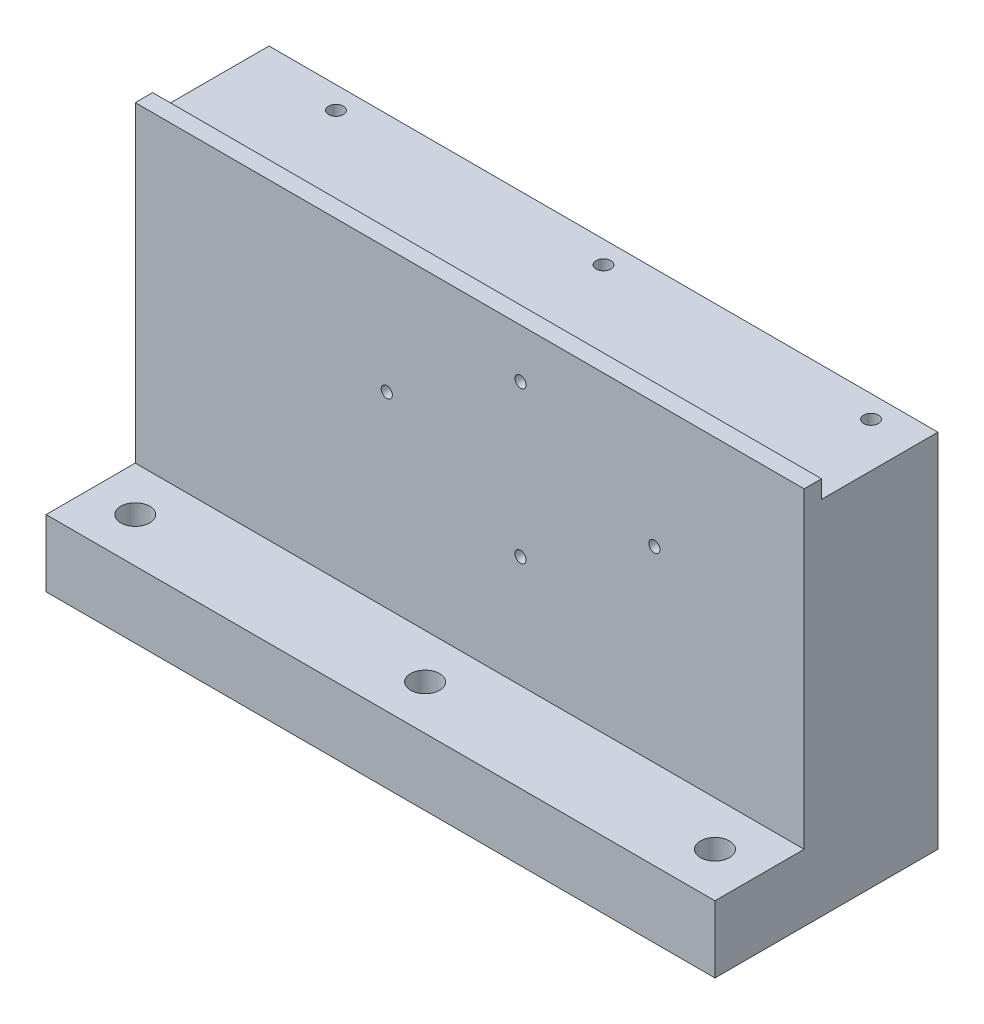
ISO-10303-21;
HEADER;
FILE_DESCRIPTION(('STEP AP214'),'2;1');
FILE_NAME('part.step','',(''),(''),'','','');
FILE_SCHEMA(('AUTOMOTIVE_DESIGN { 1 0 10303 214 1 1 1 1 }'));
ENDSEC;
DATA;
#1=APPLICATION_CONTEXT('core data for automotive mechanical design processes');
#2=APPLICATION_PROTOCOL_DEFINITION('international standard','automotive_design',2000,#1);
#3=PRODUCT_CONTEXT('',#1,'mechanical');
#4=PRODUCT('Part','Part','',(#3));
#5=PRODUCT_RELATED_PRODUCT_CATEGORY('part','',(#4));
#6=PRODUCT_DEFINITION_FORMATION('','',#4);
#7=PRODUCT_DEFINITION_CONTEXT('part definition',#1,'design');
#8=PRODUCT_DEFINITION('design','',#6,#7);
#9=PRODUCT_DEFINITION_SHAPE('','',#8);
#10=(LENGTH_UNIT() NAMED_UNIT(*) SI_UNIT(.MILLI.,.METRE.));
#11=(NAMED_UNIT(*) PLANE_ANGLE_UNIT() SI_UNIT($,.RADIAN.));
#12=(NAMED_UNIT(*) SI_UNIT($,.STERADIAN.) SOLID_ANGLE_UNIT());
#13=UNCERTAINTY_MEASURE_WITH_UNIT(LENGTH_MEASURE(1.E-05),#10,'distance_accuracy_value','');
#14=(GEOMETRIC_REPRESENTATION_CONTEXT(3) GLOBAL_UNCERTAINTY_ASSIGNED_CONTEXT((#13)) GLOBAL_UNIT_ASSIGNED_CONTEXT((#10,
#11,#12)) REPRESENTATION_CONTEXT('',''));
#15=CARTESIAN_POINT('',(0.,0.,0.));
#16=DIRECTION('',(0.,0.,1.));
#17=DIRECTION('',(1.,0.,0.));
#18=AXIS2_PLACEMENT_3D('',#15,#16,#17);
#19=CARTESIAN_POINT('',(150.,0.,50.));
#20=DIRECTION('',(-1.,0.,0.));
#21=DIRECTION('',(0.,0.,1.));
#22=AXIS2_PLACEMENT_3D('',#19,#20,#21);
#23=PLANE('',#22);
#24=DIRECTION('',(0.,0.,1.));
#25=VECTOR('',#24,1.);
#26=CARTESIAN_POINT('',(150.,15.,50.));
#27=LINE('',#26,#25);
#28=CARTESIAN_POINT('',(150.,15.,30.0000000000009));
#29=VERTEX_POINT('',#28);
#30=CARTESIAN_POINT('',(150.,15.,50.));
#31=VERTEX_POINT('',#30);
#32=EDGE_CURVE('E113',#29,#31,#27,.T.);
#33=ORIENTED_EDGE('',*,*,#32,.T.);
#34=DIRECTION('',(0.,1.,0.));
#35=VECTOR('',#34,1.);
#36=CARTESIAN_POINT('',(150.,0.,50.));
#37=LINE('',#36,#35);
#38=CARTESIAN_POINT('',(150.,0.,50.));
#39=VERTEX_POINT('',#38);
#40=EDGE_CURVE('E148',#39,#31,#37,.T.);
#41=ORIENTED_EDGE('',*,*,#40,.F.);
#42=DIRECTION('',(0.,0.,-1.));
#43=VECTOR('',#42,1.);
#44=CARTESIAN_POINT('',(150.,0.,50.));
#45=LINE('',#44,#43);
#46=CARTESIAN_POINT('',(150.,0.,0.));
#47=VERTEX_POINT('',#46);
#48=EDGE_CURVE('E12',#39,#47,#45,.T.);
#49=ORIENTED_EDGE('',*,*,#48,.T.);
#50=DIRECTION('',(0.,1.,0.));
#51=VECTOR('',#50,1.);
#52=CARTESIAN_POINT('',(150.,0.,0.));
#53=LINE('',#52,#51);
#54=CARTESIAN_POINT('',(150.,81.0000000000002,0.));
#55=VERTEX_POINT('',#54);
#56=EDGE_CURVE('E157',#47,#55,#53,.T.);
#57=ORIENTED_EDGE('',*,*,#56,.T.);
#58=DIRECTION('',(0.,0.,1.));
#59=VECTOR('',#58,1.);
#60=CARTESIAN_POINT('',(150.,81.0000000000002,26.1000000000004));
#61=LINE('',#60,#59);
#62=CARTESIAN_POINT('',(150.,81.0000000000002,26.1000000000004));
#63=VERTEX_POINT('',#62);
#64=EDGE_CURVE('E56',#55,#63,#61,.T.);
#65=ORIENTED_EDGE('',*,*,#64,.T.);
#66=DIRECTION('',(0.,1.,0.));
#67=VECTOR('',#66,1.);
#68=CARTESIAN_POINT('',(150.,81.0000000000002,26.1000000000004));
#69=LINE('',#68,#67);
#70=CARTESIAN_POINT('',(150.,85.0000000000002,26.1000000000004));
#71=VERTEX_POINT('',#70);
#72=EDGE_CURVE('E104',#63,#71,#69,.T.);
#73=ORIENTED_EDGE('',*,*,#72,.T.);
#74=DIRECTION('',(0.,0.,-1.));
#75=VECTOR('',#74,1.);
#76=CARTESIAN_POINT('',(150.,84.9999999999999,50.));
#77=LINE('',#76,#75);
#78=CARTESIAN_POINT('',(150.,85.0000000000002,30.));
#79=VERTEX_POINT('',#78);
#80=EDGE_CURVE('E41',#79,#71,#77,.T.);
#81=ORIENTED_EDGE('',*,*,#80,.F.);
#82=DIRECTION('',(0.,-1.,0.));
#83=VECTOR('',#82,1.);
#84=CARTESIAN_POINT('',(150.,15.,30.0000000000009));
#85=LINE('',#84,#83);
#86=EDGE_CURVE('E130',#79,#29,#85,.T.);
#87=ORIENTED_EDGE('',*,*,#86,.T.);
#88=EDGE_LOOP('',(#33,#41,#49,#57,#65,#73,#81,#87));
#89=FACE_BOUND('',#88,.T.);
#90=ADVANCED_FACE('F33',(#89),#23,.F.);
#91=CARTESIAN_POINT('',(0.,84.9999999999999,50.));
#92=DIRECTION('',(0.,-1.,0.));
#93=DIRECTION('',(0.,0.,-1.));
#94=AXIS2_PLACEMENT_3D('',#91,#92,#93);
#95=PLANE('',#94);
#96=DIRECTION('',(1.,0.,0.));
#97=VECTOR('',#96,1.);
#98=CARTESIAN_POINT('',(0.,85.0000000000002,30.));
#99=LINE('',#98,#97);
#100=CARTESIAN_POINT('',(0.,85.0000000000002,30.));
#101=VERTEX_POINT('',#100);
#102=EDGE_CURVE('E141',#101,#79,#99,.T.);
#103=ORIENTED_EDGE('',*,*,#102,.T.);
#104=ORIENTED_EDGE('',*,*,#80,.T.);
#105=DIRECTION('',(1.,0.,0.));
#106=VECTOR('',#105,1.);
#107=CARTESIAN_POINT('',(0.,85.0000000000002,26.1000000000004));
#108=LINE('',#107,#106);
#109=CARTESIAN_POINT('',(0.,85.0000000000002,26.1000000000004));
#110=VERTEX_POINT('',#109);
#111=EDGE_CURVE('E105',#110,#71,#108,.T.);
#112=ORIENTED_EDGE('',*,*,#111,.F.);
#113=DIRECTION('',(0.,0.,-1.));
#114=VECTOR('',#113,1.);
#115=CARTESIAN_POINT('',(0.,84.9999999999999,50.));
#116=LINE('',#115,#114);
#117=EDGE_CURVE('E119',#101,#110,#116,.T.);
#118=ORIENTED_EDGE('',*,*,#117,.F.);
#119=EDGE_LOOP('',(#103,#104,#112,#118));
#120=FACE_BOUND('',#119,.T.);
#121=ADVANCED_FACE('F166',(#120),#95,.F.);
#122=CARTESIAN_POINT('',(0.,0.,50.));
#123=DIRECTION('',(1.,0.,0.));
#124=DIRECTION('',(0.,0.,-1.));
#125=AXIS2_PLACEMENT_3D('',#122,#123,#124);
#126=PLANE('',#125);
#127=CARTESIAN_POINT('',(0.,61.9999999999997,24.));
#128=DIRECTION('',(-1.,0.,0.));
#129=DIRECTION('',(0.,0.,1.));
#130=AXIS2_PLACEMENT_3D('',#127,#128,#129);
#131=CIRCLE('',#130,2.1);
#132=CARTESIAN_POINT('',(0.,61.9999999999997,26.1));
#133=VERTEX_POINT('',#132);
#134=EDGE_CURVE('E232',#133,#133,#131,.T.);
#135=ORIENTED_EDGE('',*,*,#134,.F.);
#136=EDGE_LOOP('',(#135));
#137=FACE_BOUND('',#136,.T.);
#138=CARTESIAN_POINT('',(0.,61.9999999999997,6.));
#139=DIRECTION('',(-1.,0.,0.));
#140=DIRECTION('',(0.,0.,1.));
#141=AXIS2_PLACEMENT_3D('',#138,#139,#140);
#142=CIRCLE('',#141,2.1);
#143=CARTESIAN_POINT('',(0.,61.9999999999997,8.1));
#144=VERTEX_POINT('',#143);
#145=EDGE_CURVE('E241',#144,#144,#142,.T.);
#146=ORIENTED_EDGE('',*,*,#145,.F.);
#147=EDGE_LOOP('',(#146));
#148=FACE_BOUND('',#147,.T.);
#149=DIRECTION('',(0.,0.,1.));
#150=VECTOR('',#149,1.);
#151=CARTESIAN_POINT('',(0.,15.,50.));
#152=LINE('',#151,#150);
#153=CARTESIAN_POINT('',(0.,15.,30.0000000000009));
#154=VERTEX_POINT('',#153);
#155=CARTESIAN_POINT('',(0.,15.,50.));
#156=VERTEX_POINT('',#155);
#157=EDGE_CURVE('E48',#154,#156,#152,.T.);
#158=ORIENTED_EDGE('',*,*,#157,.F.);
#159=DIRECTION('',(0.,-1.,0.));
#160=VECTOR('',#159,1.);
#161=CARTESIAN_POINT('',(0.,15.,30.0000000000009));
#162=LINE('',#161,#160);
#163=EDGE_CURVE('E120',#101,#154,#162,.T.);
#164=ORIENTED_EDGE('',*,*,#163,.F.);
#165=ORIENTED_EDGE('',*,*,#117,.T.);
#166=DIRECTION('',(0.,1.,0.));
#167=VECTOR('',#166,1.);
#168=CARTESIAN_POINT('',(0.,81.0000000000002,26.1000000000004));
#169=LINE('',#168,#167);
#170=CARTESIAN_POINT('',(0.,81.0000000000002,26.1000000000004));
#171=VERTEX_POINT('',#170);
#172=EDGE_CURVE('E101',#171,#110,#169,.T.);
#173=ORIENTED_EDGE('',*,*,#172,.F.);
#174=DIRECTION('',(0.,0.,1.));
#175=VECTOR('',#174,1.);
#176=CARTESIAN_POINT('',(0.,81.0000000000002,26.1000000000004));
#177=LINE('',#176,#175);
#178=CARTESIAN_POINT('',(0.,81.0000000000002,0.));
#179=VERTEX_POINT('',#178);
#180=EDGE_CURVE('E108',#179,#171,#177,.T.);
#181=ORIENTED_EDGE('',*,*,#180,.F.);
#182=DIRECTION('',(0.,-1.,0.));
#183=VECTOR('',#182,1.);
#184=CARTESIAN_POINT('',(0.,0.,0.));
#185=LINE('',#184,#183);
#186=CARTESIAN_POINT('',(0.,0.,0.));
#187=VERTEX_POINT('',#186);
#188=EDGE_CURVE('E149',#179,#187,#185,.T.);
#189=ORIENTED_EDGE('',*,*,#188,.T.);
#190=DIRECTION('',(0.,0.,-1.));
#191=VECTOR('',#190,1.);
#192=CARTESIAN_POINT('',(0.,0.,50.));
#193=LINE('',#192,#191);
#194=CARTESIAN_POINT('',(0.,0.,50.));
#195=VERTEX_POINT('',#194);
#196=EDGE_CURVE('E154',#195,#187,#193,.T.);
#197=ORIENTED_EDGE('',*,*,#196,.F.);
#198=DIRECTION('',(0.,-1.,0.));
#199=VECTOR('',#198,1.);
#200=CARTESIAN_POINT('',(0.,0.,50.));
#201=LINE('',#200,#199);
#202=EDGE_CURVE('E152',#156,#195,#201,.T.);
#203=ORIENTED_EDGE('',*,*,#202,.F.);
#204=EDGE_LOOP('',(#158,#164,#165,#173,#181,#189,#197,#203));
#205=FACE_BOUND('',#204,.T.);
#206=ADVANCED_FACE('F116',(#137,#148,#205),#126,.F.);
#207=CARTESIAN_POINT('',(150.,0.,50.));
#208=DIRECTION('',(0.,0.,1.));
#209=DIRECTION('',(1.,0.,0.));
#210=AXIS2_PLACEMENT_3D('',#207,#208,#209);
#211=PLANE('',#210);
#212=ORIENTED_EDGE('',*,*,#40,.T.);
#213=DIRECTION('',(1.,0.,0.));
#214=VECTOR('',#213,1.);
#215=CARTESIAN_POINT('',(0.,15.,50.));
#216=LINE('',#215,#214);
#217=EDGE_CURVE('E137',#156,#31,#216,.T.);
#218=ORIENTED_EDGE('',*,*,#217,.F.);
#219=ORIENTED_EDGE('',*,*,#202,.T.);
#220=DIRECTION('',(1.,0.,0.));
#221=VECTOR('',#220,1.);
#222=CARTESIAN_POINT('',(0.,0.,50.));
#223=LINE('',#222,#221);
#224=EDGE_CURVE('E145',#195,#39,#223,.T.);
#225=ORIENTED_EDGE('',*,*,#224,.T.);
#226=EDGE_LOOP('',(#212,#218,#219,#225));
#227=FACE_BOUND('',#226,.T.);
#228=ADVANCED_FACE('F177',(#227),#211,.T.);
#229=CARTESIAN_POINT('',(150.,0.,0.));
#230=DIRECTION('',(0.,0.,1.));
#231=DIRECTION('',(1.,0.,0.));
#232=AXIS2_PLACEMENT_3D('',#229,#230,#231);
#233=PLANE('',#232);
#234=CARTESIAN_POINT('',(116.25,70.0000000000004,0.));
#235=DIRECTION('',(0.,0.,-1.));
#236=DIRECTION('',(-1.,0.,0.));
#237=AXIS2_PLACEMENT_3D('',#234,#235,#236);
#238=CIRCLE('',#237,1.64999999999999);
#239=CARTESIAN_POINT('',(114.6,70.0000000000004,0.));
#240=VERTEX_POINT('',#239);
#241=EDGE_CURVE('E247',#240,#240,#238,.T.);
#242=ORIENTED_EDGE('',*,*,#241,.F.);
#243=EDGE_LOOP('',(#242));
#244=FACE_BOUND('',#243,.T.);
#245=CARTESIAN_POINT('',(146.25,70.0000000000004,0.));
#246=DIRECTION('',(0.,0.,-1.));
#247=DIRECTION('',(-1.,0.,0.));
#248=AXIS2_PLACEMENT_3D('',#245,#246,#247);
#249=CIRCLE('',#248,1.65000000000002);
#250=CARTESIAN_POINT('',(144.6,70.0000000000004,0.));
#251=VERTEX_POINT('',#250);
#252=EDGE_CURVE('E253',#251,#251,#249,.T.);
#253=ORIENTED_EDGE('',*,*,#252,.F.);
#254=EDGE_LOOP('',(#253));
#255=FACE_BOUND('',#254,.T.);
#256=DIRECTION('',(1.,0.,0.));
#257=VECTOR('',#256,1.);
#258=CARTESIAN_POINT('',(0.,81.0000000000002,0.));
#259=LINE('',#258,#257);
#260=EDGE_CURVE('E110',#179,#55,#259,.T.);
#261=ORIENTED_EDGE('',*,*,#260,.T.);
#262=ORIENTED_EDGE('',*,*,#56,.F.);
#263=DIRECTION('',(1.,0.,0.));
#264=VECTOR('',#263,1.);
#265=CARTESIAN_POINT('',(0.,0.,0.));
#266=LINE('',#265,#264);
#267=EDGE_CURVE('E136',#187,#47,#266,.T.);
#268=ORIENTED_EDGE('',*,*,#267,.F.);
#269=ORIENTED_EDGE('',*,*,#188,.F.);
#270=EDGE_LOOP('',(#261,#262,#268,#269));
#271=FACE_BOUND('',#270,.T.);
#272=ADVANCED_FACE('F171',(#244,#255,#271),#233,.F.);
#273=CARTESIAN_POINT('',(0.,0.,50.));
#274=DIRECTION('',(0.,1.,0.));
#275=DIRECTION('',(0.,0.,1.));
#276=AXIS2_PLACEMENT_3D('',#273,#274,#275);
#277=PLANE('',#276);
#278=CARTESIAN_POINT('',(140.,0.,40.));
#279=DIRECTION('',(0.,1.,0.));
#280=DIRECTION('',(0.,0.,1.));
#281=AXIS2_PLACEMENT_3D('',#278,#279,#280);
#282=CIRCLE('',#281,3.25);
#283=CARTESIAN_POINT('',(140.,0.,43.25));
#284=VERTEX_POINT('',#283);
#285=EDGE_CURVE('E391',#284,#284,#282,.T.);
#286=ORIENTED_EDGE('',*,*,#285,.T.);
#287=EDGE_LOOP('',(#286));
#288=FACE_BOUND('',#287,.T.);
#289=CARTESIAN_POINT('',(75.,0.,40.));
#290=DIRECTION('',(0.,1.,0.));
#291=DIRECTION('',(0.,0.,1.));
#292=AXIS2_PLACEMENT_3D('',#289,#290,#291);
#293=CIRCLE('',#292,3.25);
#294=CARTESIAN_POINT('',(75.,0.,43.25));
#295=VERTEX_POINT('',#294);
#296=EDGE_CURVE('E398',#295,#295,#293,.T.);
#297=ORIENTED_EDGE('',*,*,#296,.T.);
#298=EDGE_LOOP('',(#297));
#299=FACE_BOUND('',#298,.T.);
#300=CARTESIAN_POINT('',(10.,0.,40.));
#301=DIRECTION('',(0.,1.,0.));
#302=DIRECTION('',(0.,0.,1.));
#303=AXIS2_PLACEMENT_3D('',#300,#301,#302);
#304=CIRCLE('',#303,3.25);
#305=CARTESIAN_POINT('',(10.,0.,43.25));
#306=VERTEX_POINT('',#305);
#307=EDGE_CURVE('E404',#306,#306,#304,.T.);
#308=ORIENTED_EDGE('',*,*,#307,.T.);
#309=EDGE_LOOP('',(#308));
#310=FACE_BOUND('',#309,.T.);
#311=ORIENTED_EDGE('',*,*,#267,.T.);
#312=ORIENTED_EDGE('',*,*,#48,.F.);
#313=ORIENTED_EDGE('',*,*,#224,.F.);
#314=ORIENTED_EDGE('',*,*,#196,.T.);
#315=EDGE_LOOP('',(#311,#312,#313,#314));
#316=FACE_BOUND('',#315,.T.);
#317=ADVANCED_FACE('F35',(#288,#299,#310,#316),#277,.F.);
#318=CARTESIAN_POINT('',(0.,81.0000000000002,26.1000000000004));
#319=DIRECTION('',(0.,1.,0.));
#320=DIRECTION('',(0.,0.,1.));
#321=AXIS2_PLACEMENT_3D('',#318,#319,#320);
#322=PLANE('',#321);
#323=CARTESIAN_POINT('',(80.,81.0000000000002,5.));
#324=DIRECTION('',(0.,1.,0.));
#325=DIRECTION('',(0.,0.,1.));
#326=AXIS2_PLACEMENT_3D('',#323,#324,#325);
#327=CIRCLE('',#326,1.65);
#328=CARTESIAN_POINT('',(80.,81.0000000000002,6.65));
#329=VERTEX_POINT('',#328);
#330=EDGE_CURVE('E219',#329,#329,#327,.T.);
#331=ORIENTED_EDGE('',*,*,#330,.F.);
#332=EDGE_LOOP('',(#331));
#333=FACE_BOUND('',#332,.T.);
#334=CARTESIAN_POINT('',(140.,81.0000000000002,5.));
#335=DIRECTION('',(0.,1.,0.));
#336=DIRECTION('',(0.,0.,1.));
#337=AXIS2_PLACEMENT_3D('',#334,#335,#336);
#338=CIRCLE('',#337,1.65000000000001);
#339=CARTESIAN_POINT('',(140.,81.0000000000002,6.65000000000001));
#340=VERTEX_POINT('',#339);
#341=EDGE_CURVE('E223',#340,#340,#338,.T.);
#342=ORIENTED_EDGE('',*,*,#341,.F.);
#343=EDGE_LOOP('',(#342));
#344=FACE_BOUND('',#343,.T.);
#345=CARTESIAN_POINT('',(20.,81.0000000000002,5.));
#346=DIRECTION('',(0.,1.,0.));
#347=DIRECTION('',(0.,0.,1.));
#348=AXIS2_PLACEMENT_3D('',#345,#346,#347);
#349=CIRCLE('',#348,1.65);
#350=CARTESIAN_POINT('',(20.,81.0000000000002,6.65));
#351=VERTEX_POINT('',#350);
#352=EDGE_CURVE('E226',#351,#351,#349,.T.);
#353=ORIENTED_EDGE('',*,*,#352,.F.);
#354=EDGE_LOOP('',(#353));
#355=FACE_BOUND('',#354,.T.);
#356=ORIENTED_EDGE('',*,*,#64,.F.);
#357=ORIENTED_EDGE('',*,*,#260,.F.);
#358=ORIENTED_EDGE('',*,*,#180,.T.);
#359=DIRECTION('',(1.,0.,0.));
#360=VECTOR('',#359,1.);
#361=CARTESIAN_POINT('',(0.,81.0000000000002,26.1000000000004));
#362=LINE('',#361,#360);
#363=EDGE_CURVE('E97',#171,#63,#362,.T.);
#364=ORIENTED_EDGE('',*,*,#363,.T.);
#365=EDGE_LOOP('',(#356,#357,#358,#364));
#366=FACE_BOUND('',#365,.T.);
#367=ADVANCED_FACE('F109',(#333,#344,#355,#366),#322,.T.);
#368=CARTESIAN_POINT('',(0.,81.0000000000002,26.1000000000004));
#369=DIRECTION('',(0.,0.,-1.));
#370=DIRECTION('',(-1.,0.,0.));
#371=AXIS2_PLACEMENT_3D('',#368,#369,#370);
#372=PLANE('',#371);
#373=ORIENTED_EDGE('',*,*,#72,.F.);
#374=ORIENTED_EDGE('',*,*,#363,.F.);
#375=ORIENTED_EDGE('',*,*,#172,.T.);
#376=ORIENTED_EDGE('',*,*,#111,.T.);
#377=EDGE_LOOP('',(#373,#374,#375,#376));
#378=FACE_BOUND('',#377,.T.);
#379=ADVANCED_FACE('F99',(#378),#372,.T.);
#380=CARTESIAN_POINT('',(0.,15.,50.));
#381=DIRECTION('',(0.,1.,0.));
#382=DIRECTION('',(0.,0.,1.));
#383=AXIS2_PLACEMENT_3D('',#380,#381,#382);
#384=PLANE('',#383);
#385=CARTESIAN_POINT('',(140.,15.,40.));
#386=DIRECTION('',(0.,1.,0.));
#387=DIRECTION('',(0.,0.,1.));
#388=AXIS2_PLACEMENT_3D('',#385,#386,#387);
#389=CIRCLE('',#388,3.25);
#390=CARTESIAN_POINT('',(140.,15.,43.25));
#391=VERTEX_POINT('',#390);
#392=EDGE_CURVE('E393',#391,#391,#389,.T.);
#393=ORIENTED_EDGE('',*,*,#392,.F.);
#394=EDGE_LOOP('',(#393));
#395=FACE_BOUND('',#394,.T.);
#396=CARTESIAN_POINT('',(75.,15.,40.));
#397=DIRECTION('',(0.,1.,0.));
#398=DIRECTION('',(0.,0.,1.));
#399=AXIS2_PLACEMENT_3D('',#396,#397,#398);
#400=CIRCLE('',#399,3.25);
#401=CARTESIAN_POINT('',(75.,15.,43.25));
#402=VERTEX_POINT('',#401);
#403=EDGE_CURVE('E395',#402,#402,#400,.T.);
#404=ORIENTED_EDGE('',*,*,#403,.F.);
#405=EDGE_LOOP('',(#404));
#406=FACE_BOUND('',#405,.T.);
#407=CARTESIAN_POINT('',(10.,15.,40.));
#408=DIRECTION('',(0.,1.,0.));
#409=DIRECTION('',(0.,0.,1.));
#410=AXIS2_PLACEMENT_3D('',#407,#408,#409);
#411=CIRCLE('',#410,3.25);
#412=CARTESIAN_POINT('',(10.,15.,43.25));
#413=VERTEX_POINT('',#412);
#414=EDGE_CURVE('E401',#413,#413,#411,.T.);
#415=ORIENTED_EDGE('',*,*,#414,.F.);
#416=EDGE_LOOP('',(#415));
#417=FACE_BOUND('',#416,.T.);
#418=ORIENTED_EDGE('',*,*,#32,.F.);
#419=DIRECTION('',(1.,0.,0.));
#420=VECTOR('',#419,1.);
#421=CARTESIAN_POINT('',(0.,15.,30.0000000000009));
#422=LINE('',#421,#420);
#423=EDGE_CURVE('E139',#154,#29,#422,.T.);
#424=ORIENTED_EDGE('',*,*,#423,.F.);
#425=ORIENTED_EDGE('',*,*,#157,.T.);
#426=ORIENTED_EDGE('',*,*,#217,.T.);
#427=EDGE_LOOP('',(#418,#424,#425,#426));
#428=FACE_BOUND('',#427,.T.);
#429=ADVANCED_FACE('F181',(#395,#406,#417,#428),#384,.T.);
#430=CARTESIAN_POINT('',(0.,15.,30.0000000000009));
#431=DIRECTION('',(0.,0.,1.));
#432=DIRECTION('',(0.,-1.,0.));
#433=AXIS2_PLACEMENT_3D('',#430,#431,#432);
#434=PLANE('',#433);
#435=CARTESIAN_POINT('',(86.3999999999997,40.0000000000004,30.0000000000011));
#436=DIRECTION('',(0.,0.,1.));
#437=DIRECTION('',(1.,0.,0.));
#438=AXIS2_PLACEMENT_3D('',#435,#436,#437);
#439=CIRCLE('',#438,1.25);
#440=CARTESIAN_POINT('',(87.6499999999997,40.0000000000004,30.0000000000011));
#441=VERTEX_POINT('',#440);
#442=EDGE_CURVE('E259',#441,#441,#439,.T.);
#443=ORIENTED_EDGE('',*,*,#442,.F.);
#444=EDGE_LOOP('',(#443));
#445=FACE_BOUND('',#444,.T.);
#446=CARTESIAN_POINT('',(86.3999999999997,74.0000000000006,30.0000000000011));
#447=DIRECTION('',(0.,0.,1.));
#448=DIRECTION('',(1.,0.,0.));
#449=AXIS2_PLACEMENT_3D('',#446,#447,#448);
#450=CIRCLE('',#449,1.25);
#451=CARTESIAN_POINT('',(87.6499999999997,74.0000000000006,30.0000000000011));
#452=VERTEX_POINT('',#451);
#453=EDGE_CURVE('E265',#452,#452,#450,.T.);
#454=ORIENTED_EDGE('',*,*,#453,.F.);
#455=EDGE_LOOP('',(#454));
#456=FACE_BOUND('',#455,.T.);
#457=CARTESIAN_POINT('',(116.4,57.0000000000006,30.0000000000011));
#458=DIRECTION('',(0.,0.,1.));
#459=DIRECTION('',(1.,0.,0.));
#460=AXIS2_PLACEMENT_3D('',#457,#458,#459);
#461=CIRCLE('',#460,1.25);
#462=CARTESIAN_POINT('',(117.65,57.0000000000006,30.0000000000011));
#463=VERTEX_POINT('',#462);
#464=EDGE_CURVE('E271',#463,#463,#461,.T.);
#465=ORIENTED_EDGE('',*,*,#464,.F.);
#466=EDGE_LOOP('',(#465));
#467=FACE_BOUND('',#466,.T.);
#468=CARTESIAN_POINT('',(56.3999999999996,57.0000000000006,30.0000000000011));
#469=DIRECTION('',(0.,0.,1.));
#470=DIRECTION('',(1.,0.,0.));
#471=AXIS2_PLACEMENT_3D('',#468,#469,#470);
#472=CIRCLE('',#471,1.25);
#473=CARTESIAN_POINT('',(57.6499999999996,57.0000000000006,30.0000000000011));
#474=VERTEX_POINT('',#473);
#475=EDGE_CURVE('E277',#474,#474,#472,.T.);
#476=ORIENTED_EDGE('',*,*,#475,.F.);
#477=EDGE_LOOP('',(#476));
#478=FACE_BOUND('',#477,.T.);
#479=ORIENTED_EDGE('',*,*,#86,.F.);
#480=ORIENTED_EDGE('',*,*,#102,.F.);
#481=ORIENTED_EDGE('',*,*,#163,.T.);
#482=ORIENTED_EDGE('',*,*,#423,.T.);
#483=EDGE_LOOP('',(#479,#480,#481,#482));
#484=FACE_BOUND('',#483,.T.);
#485=ADVANCED_FACE('F179',(#445,#456,#467,#478,#484),#434,.T.);
#486=CARTESIAN_POINT('',(56.3999999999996,57.0000000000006,20.0000000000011));
#487=DIRECTION('',(0.,0.,1.));
#488=DIRECTION('',(1.,0.,0.));
#489=AXIS2_PLACEMENT_3D('',#486,#487,#488);
#490=CYLINDRICAL_SURFACE('',#489,1.25);
#491=CARTESIAN_POINT('',(56.3999999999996,57.0000000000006,20.0000000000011));
#492=DIRECTION('',(0.,0.,1.));
#493=DIRECTION('',(1.,0.,0.));
#494=AXIS2_PLACEMENT_3D('',#491,#492,#493);
#495=CIRCLE('',#494,1.25);
#496=CARTESIAN_POINT('',(57.6499999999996,57.0000000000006,20.0000000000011));
#497=VERTEX_POINT('',#496);
#498=EDGE_CURVE('E128',#497,#497,#495,.T.);
#499=ORIENTED_EDGE('',*,*,#498,.F.);
#500=EDGE_LOOP('',(#499));
#501=FACE_BOUND('',#500,.T.);
#502=ORIENTED_EDGE('',*,*,#475,.T.);
#503=EDGE_LOOP('',(#502));
#504=FACE_BOUND('',#503,.T.);
#505=ADVANCED_FACE('F189',(#501,#504),#490,.F.);
#506=CARTESIAN_POINT('',(56.3999999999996,57.0000000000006,20.0000000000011));
#507=DIRECTION('',(0.,0.,1.));
#508=DIRECTION('',(1.,0.,0.));
#509=AXIS2_PLACEMENT_3D('',#506,#507,#508);
#510=PLANE('',#509);
#511=ORIENTED_EDGE('',*,*,#498,.T.);
#512=EDGE_LOOP('',(#511));
#513=FACE_BOUND('',#512,.T.);
#514=ADVANCED_FACE('F286',(#513),#510,.T.);
#515=CARTESIAN_POINT('',(116.4,57.0000000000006,20.0000000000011));
#516=DIRECTION('',(0.,0.,1.));
#517=DIRECTION('',(1.,0.,0.));
#518=AXIS2_PLACEMENT_3D('',#515,#516,#517);
#519=CYLINDRICAL_SURFACE('',#518,1.25);
#520=CARTESIAN_POINT('',(116.4,57.0000000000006,20.0000000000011));
#521=DIRECTION('',(0.,0.,1.));
#522=DIRECTION('',(1.,0.,0.));
#523=AXIS2_PLACEMENT_3D('',#520,#521,#522);
#524=CIRCLE('',#523,1.25);
#525=CARTESIAN_POINT('',(117.65,57.0000000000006,20.0000000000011));
#526=VERTEX_POINT('',#525);
#527=EDGE_CURVE('E274',#526,#526,#524,.T.);
#528=ORIENTED_EDGE('',*,*,#527,.F.);
#529=EDGE_LOOP('',(#528));
#530=FACE_BOUND('',#529,.T.);
#531=ORIENTED_EDGE('',*,*,#464,.T.);
#532=EDGE_LOOP('',(#531));
#533=FACE_BOUND('',#532,.T.);
#534=ADVANCED_FACE('F291',(#530,#533),#519,.F.);
#535=CARTESIAN_POINT('',(116.4,57.0000000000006,20.0000000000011));
#536=DIRECTION('',(0.,0.,1.));
#537=DIRECTION('',(1.,0.,0.));
#538=AXIS2_PLACEMENT_3D('',#535,#536,#537);
#539=PLANE('',#538);
#540=ORIENTED_EDGE('',*,*,#527,.T.);
#541=EDGE_LOOP('',(#540));
#542=FACE_BOUND('',#541,.T.);
#543=ADVANCED_FACE('F298',(#542),#539,.T.);
#544=CARTESIAN_POINT('',(86.3999999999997,74.0000000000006,20.0000000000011));
#545=DIRECTION('',(0.,0.,1.));
#546=DIRECTION('',(1.,0.,0.));
#547=AXIS2_PLACEMENT_3D('',#544,#545,#546);
#548=CYLINDRICAL_SURFACE('',#547,1.25);
#549=CARTESIAN_POINT('',(86.3999999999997,74.0000000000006,20.0000000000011));
#550=DIRECTION('',(0.,0.,1.));
#551=DIRECTION('',(1.,0.,0.));
#552=AXIS2_PLACEMENT_3D('',#549,#550,#551);
#553=CIRCLE('',#552,1.25);
#554=CARTESIAN_POINT('',(87.6499999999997,74.0000000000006,20.0000000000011));
#555=VERTEX_POINT('',#554);
#556=EDGE_CURVE('E268',#555,#555,#553,.T.);
#557=ORIENTED_EDGE('',*,*,#556,.F.);
#558=EDGE_LOOP('',(#557));
#559=FACE_BOUND('',#558,.T.);
#560=ORIENTED_EDGE('',*,*,#453,.T.);
#561=EDGE_LOOP('',(#560));
#562=FACE_BOUND('',#561,.T.);
#563=ADVANCED_FACE('F302',(#559,#562),#548,.F.);
#564=CARTESIAN_POINT('',(86.3999999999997,74.0000000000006,20.0000000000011));
#565=DIRECTION('',(0.,0.,1.));
#566=DIRECTION('',(1.,0.,0.));
#567=AXIS2_PLACEMENT_3D('',#564,#565,#566);
#568=PLANE('',#567);
#569=ORIENTED_EDGE('',*,*,#556,.T.);
#570=EDGE_LOOP('',(#569));
#571=FACE_BOUND('',#570,.T.);
#572=ADVANCED_FACE('F306',(#571),#568,.T.);
#573=CARTESIAN_POINT('',(86.3999999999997,40.0000000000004,20.0000000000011));
#574=DIRECTION('',(0.,0.,1.));
#575=DIRECTION('',(1.,0.,0.));
#576=AXIS2_PLACEMENT_3D('',#573,#574,#575);
#577=CYLINDRICAL_SURFACE('',#576,1.25);
#578=CARTESIAN_POINT('',(86.3999999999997,40.0000000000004,20.0000000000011));
#579=DIRECTION('',(0.,0.,1.));
#580=DIRECTION('',(1.,0.,0.));
#581=AXIS2_PLACEMENT_3D('',#578,#579,#580);
#582=CIRCLE('',#581,1.25);
#583=CARTESIAN_POINT('',(87.6499999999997,40.0000000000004,20.0000000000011));
#584=VERTEX_POINT('',#583);
#585=EDGE_CURVE('E262',#584,#584,#582,.T.);
#586=ORIENTED_EDGE('',*,*,#585,.F.);
#587=EDGE_LOOP('',(#586));
#588=FACE_BOUND('',#587,.T.);
#589=ORIENTED_EDGE('',*,*,#442,.T.);
#590=EDGE_LOOP('',(#589));
#591=FACE_BOUND('',#590,.T.);
#592=ADVANCED_FACE('F310',(#588,#591),#577,.F.);
#593=CARTESIAN_POINT('',(86.3999999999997,40.0000000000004,20.0000000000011));
#594=DIRECTION('',(0.,0.,1.));
#595=DIRECTION('',(1.,0.,0.));
#596=AXIS2_PLACEMENT_3D('',#593,#594,#595);
#597=PLANE('',#596);
#598=ORIENTED_EDGE('',*,*,#585,.T.);
#599=EDGE_LOOP('',(#598));
#600=FACE_BOUND('',#599,.T.);
#601=ADVANCED_FACE('F314',(#600),#597,.T.);
#602=CARTESIAN_POINT('',(146.25,70.0000000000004,10.));
#603=DIRECTION('',(0.,0.,-1.));
#604=DIRECTION('',(-1.,0.,0.));
#605=AXIS2_PLACEMENT_3D('',#602,#603,#604);
#606=CYLINDRICAL_SURFACE('',#605,1.65000000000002);
#607=CARTESIAN_POINT('',(146.25,70.0000000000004,10.));
#608=DIRECTION('',(0.,0.,-1.));
#609=DIRECTION('',(-1.,0.,0.));
#610=AXIS2_PLACEMENT_3D('',#607,#608,#609);
#611=CIRCLE('',#610,1.65000000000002);
#612=CARTESIAN_POINT('',(144.6,70.0000000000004,10.));
#613=VERTEX_POINT('',#612);
#614=EDGE_CURVE('E256',#613,#613,#611,.T.);
#615=ORIENTED_EDGE('',*,*,#614,.F.);
#616=EDGE_LOOP('',(#615));
#617=FACE_BOUND('',#616,.T.);
#618=ORIENTED_EDGE('',*,*,#252,.T.);
#619=EDGE_LOOP('',(#618));
#620=FACE_BOUND('',#619,.T.);
#621=ADVANCED_FACE('F318',(#617,#620),#606,.F.);
#622=CARTESIAN_POINT('',(146.25,70.0000000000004,10.));
#623=DIRECTION('',(0.,0.,-1.));
#624=DIRECTION('',(-1.,0.,0.));
#625=AXIS2_PLACEMENT_3D('',#622,#623,#624);
#626=PLANE('',#625);
#627=ORIENTED_EDGE('',*,*,#614,.T.);
#628=EDGE_LOOP('',(#627));
#629=FACE_BOUND('',#628,.T.);
#630=ADVANCED_FACE('F322',(#629),#626,.T.);
#631=CARTESIAN_POINT('',(116.25,70.0000000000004,10.));
#632=DIRECTION('',(0.,0.,-1.));
#633=DIRECTION('',(-1.,0.,0.));
#634=AXIS2_PLACEMENT_3D('',#631,#632,#633);
#635=CYLINDRICAL_SURFACE('',#634,1.64999999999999);
#636=CARTESIAN_POINT('',(116.25,70.0000000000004,10.));
#637=DIRECTION('',(0.,0.,-1.));
#638=DIRECTION('',(-1.,0.,0.));
#639=AXIS2_PLACEMENT_3D('',#636,#637,#638);
#640=CIRCLE('',#639,1.64999999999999);
#641=CARTESIAN_POINT('',(114.6,70.0000000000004,10.));
#642=VERTEX_POINT('',#641);
#643=EDGE_CURVE('E250',#642,#642,#640,.T.);
#644=ORIENTED_EDGE('',*,*,#643,.F.);
#645=EDGE_LOOP('',(#644));
#646=FACE_BOUND('',#645,.T.);
#647=ORIENTED_EDGE('',*,*,#241,.T.);
#648=EDGE_LOOP('',(#647));
#649=FACE_BOUND('',#648,.T.);
#650=ADVANCED_FACE('F326',(#646,#649),#635,.F.);
#651=CARTESIAN_POINT('',(116.25,70.0000000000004,10.));
#652=DIRECTION('',(0.,0.,-1.));
#653=DIRECTION('',(-1.,0.,0.));
#654=AXIS2_PLACEMENT_3D('',#651,#652,#653);
#655=PLANE('',#654);
#656=ORIENTED_EDGE('',*,*,#643,.T.);
#657=EDGE_LOOP('',(#656));
#658=FACE_BOUND('',#657,.T.);
#659=ADVANCED_FACE('F330',(#658),#655,.T.);
#660=CARTESIAN_POINT('',(10.,61.9999999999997,6.));
#661=DIRECTION('',(-1.,0.,0.));
#662=DIRECTION('',(0.,0.,1.));
#663=AXIS2_PLACEMENT_3D('',#660,#661,#662);
#664=CYLINDRICAL_SURFACE('',#663,2.1);
#665=CARTESIAN_POINT('',(10.,61.9999999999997,6.));
#666=DIRECTION('',(-1.,0.,0.));
#667=DIRECTION('',(0.,0.,1.));
#668=AXIS2_PLACEMENT_3D('',#665,#666,#667);
#669=CIRCLE('',#668,2.1);
#670=CARTESIAN_POINT('',(10.,61.9999999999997,8.1));
#671=VERTEX_POINT('',#670);
#672=EDGE_CURVE('E244',#671,#671,#669,.T.);
#673=ORIENTED_EDGE('',*,*,#672,.F.);
#674=EDGE_LOOP('',(#673));
#675=FACE_BOUND('',#674,.T.);
#676=ORIENTED_EDGE('',*,*,#145,.T.);
#677=EDGE_LOOP('',(#676));
#678=FACE_BOUND('',#677,.T.);
#679=ADVANCED_FACE('F334',(#675,#678),#664,.F.);
#680=CARTESIAN_POINT('',(10.,61.9999999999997,6.));
#681=DIRECTION('',(-1.,0.,0.));
#682=DIRECTION('',(0.,0.,1.));
#683=AXIS2_PLACEMENT_3D('',#680,#681,#682);
#684=PLANE('',#683);
#685=ORIENTED_EDGE('',*,*,#672,.T.);
#686=EDGE_LOOP('',(#685));
#687=FACE_BOUND('',#686,.T.);
#688=ADVANCED_FACE('F338',(#687),#684,.T.);
#689=CARTESIAN_POINT('',(10.,61.9999999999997,24.));
#690=DIRECTION('',(-1.,0.,0.));
#691=DIRECTION('',(0.,0.,1.));
#692=AXIS2_PLACEMENT_3D('',#689,#690,#691);
#693=CYLINDRICAL_SURFACE('',#692,2.1);
#694=CARTESIAN_POINT('',(10.,61.9999999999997,24.));
#695=DIRECTION('',(-1.,0.,0.));
#696=DIRECTION('',(0.,0.,1.));
#697=AXIS2_PLACEMENT_3D('',#694,#695,#696);
#698=CIRCLE('',#697,2.1);
#699=CARTESIAN_POINT('',(10.,61.9999999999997,26.1));
#700=VERTEX_POINT('',#699);
#701=EDGE_CURVE('E238',#700,#700,#698,.T.);
#702=ORIENTED_EDGE('',*,*,#701,.F.);
#703=EDGE_LOOP('',(#702));
#704=FACE_BOUND('',#703,.T.);
#705=ORIENTED_EDGE('',*,*,#134,.T.);
#706=EDGE_LOOP('',(#705));
#707=FACE_BOUND('',#706,.T.);
#708=ADVANCED_FACE('F342',(#704,#707),#693,.F.);
#709=CARTESIAN_POINT('',(10.,61.9999999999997,24.));
#710=DIRECTION('',(-1.,0.,0.));
#711=DIRECTION('',(0.,0.,1.));
#712=AXIS2_PLACEMENT_3D('',#709,#710,#711);
#713=PLANE('',#712);
#714=ORIENTED_EDGE('',*,*,#701,.T.);
#715=EDGE_LOOP('',(#714));
#716=FACE_BOUND('',#715,.T.);
#717=ADVANCED_FACE('F346',(#716),#713,.T.);
#718=CARTESIAN_POINT('',(20.,71.0000000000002,5.));
#719=DIRECTION('',(0.,1.,0.));
#720=DIRECTION('',(0.,0.,1.));
#721=AXIS2_PLACEMENT_3D('',#718,#719,#720);
#722=CYLINDRICAL_SURFACE('',#721,1.65);
#723=CARTESIAN_POINT('',(20.,71.0000000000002,5.));
#724=DIRECTION('',(0.,1.,0.));
#725=DIRECTION('',(0.,0.,1.));
#726=AXIS2_PLACEMENT_3D('',#723,#724,#725);
#727=CIRCLE('',#726,1.65);
#728=CARTESIAN_POINT('',(20.,71.0000000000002,6.65));
#729=VERTEX_POINT('',#728);
#730=EDGE_CURVE('E228',#729,#729,#727,.T.);
#731=ORIENTED_EDGE('',*,*,#730,.F.);
#732=EDGE_LOOP('',(#731));
#733=FACE_BOUND('',#732,.T.);
#734=ORIENTED_EDGE('',*,*,#352,.T.);
#735=EDGE_LOOP('',(#734));
#736=FACE_BOUND('',#735,.T.);
#737=ADVANCED_FACE('F350',(#733,#736),#722,.F.);
#738=CARTESIAN_POINT('',(20.,71.0000000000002,5.));
#739=DIRECTION('',(0.,1.,0.));
#740=DIRECTION('',(0.,0.,1.));
#741=AXIS2_PLACEMENT_3D('',#738,#739,#740);
#742=PLANE('',#741);
#743=ORIENTED_EDGE('',*,*,#730,.T.);
#744=EDGE_LOOP('',(#743));
#745=FACE_BOUND('',#744,.T.);
#746=ADVANCED_FACE('F354',(#745),#742,.T.);
#747=CARTESIAN_POINT('',(140.,71.0000000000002,5.));
#748=DIRECTION('',(0.,1.,0.));
#749=DIRECTION('',(0.,0.,1.));
#750=AXIS2_PLACEMENT_3D('',#747,#748,#749);
#751=CYLINDRICAL_SURFACE('',#750,1.65000000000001);
#752=CARTESIAN_POINT('',(140.,71.0000000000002,5.));
#753=DIRECTION('',(0.,1.,0.));
#754=DIRECTION('',(0.,0.,1.));
#755=AXIS2_PLACEMENT_3D('',#752,#753,#754);
#756=CIRCLE('',#755,1.65000000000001);
#757=CARTESIAN_POINT('',(140.,71.0000000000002,6.65000000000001));
#758=VERTEX_POINT('',#757);
#759=EDGE_CURVE('E229',#758,#758,#756,.T.);
#760=ORIENTED_EDGE('',*,*,#759,.F.);
#761=EDGE_LOOP('',(#760));
#762=FACE_BOUND('',#761,.T.);
#763=ORIENTED_EDGE('',*,*,#341,.T.);
#764=EDGE_LOOP('',(#763));
#765=FACE_BOUND('',#764,.T.);
#766=ADVANCED_FACE('F358',(#762,#765),#751,.F.);
#767=CARTESIAN_POINT('',(140.,71.0000000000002,5.));
#768=DIRECTION('',(0.,1.,0.));
#769=DIRECTION('',(0.,0.,1.));
#770=AXIS2_PLACEMENT_3D('',#767,#768,#769);
#771=PLANE('',#770);
#772=ORIENTED_EDGE('',*,*,#759,.T.);
#773=EDGE_LOOP('',(#772));
#774=FACE_BOUND('',#773,.T.);
#775=ADVANCED_FACE('F362',(#774),#771,.T.);
#776=CARTESIAN_POINT('',(80.,71.0000000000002,5.));
#777=DIRECTION('',(0.,1.,0.));
#778=DIRECTION('',(0.,0.,1.));
#779=AXIS2_PLACEMENT_3D('',#776,#777,#778);
#780=CYLINDRICAL_SURFACE('',#779,1.65);
#781=CARTESIAN_POINT('',(80.,71.0000000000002,5.));
#782=DIRECTION('',(0.,1.,0.));
#783=DIRECTION('',(0.,0.,1.));
#784=AXIS2_PLACEMENT_3D('',#781,#782,#783);
#785=CIRCLE('',#784,1.65);
#786=CARTESIAN_POINT('',(80.,71.0000000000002,6.65));
#787=VERTEX_POINT('',#786);
#788=EDGE_CURVE('E409',#787,#787,#785,.T.);
#789=ORIENTED_EDGE('',*,*,#788,.F.);
#790=EDGE_LOOP('',(#789));
#791=FACE_BOUND('',#790,.T.);
#792=ORIENTED_EDGE('',*,*,#330,.T.);
#793=EDGE_LOOP('',(#792));
#794=FACE_BOUND('',#793,.T.);
#795=ADVANCED_FACE('F366',(#791,#794),#780,.F.);
#796=CARTESIAN_POINT('',(80.,71.0000000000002,5.));
#797=DIRECTION('',(0.,1.,0.));
#798=DIRECTION('',(0.,0.,1.));
#799=AXIS2_PLACEMENT_3D('',#796,#797,#798);
#800=PLANE('',#799);
#801=ORIENTED_EDGE('',*,*,#788,.T.);
#802=EDGE_LOOP('',(#801));
#803=FACE_BOUND('',#802,.T.);
#804=ADVANCED_FACE('F370',(#803),#800,.T.);
#805=CARTESIAN_POINT('',(10.,0.,40.));
#806=DIRECTION('',(0.,1.,0.));
#807=DIRECTION('',(0.,0.,1.));
#808=AXIS2_PLACEMENT_3D('',#805,#806,#807);
#809=CYLINDRICAL_SURFACE('',#808,3.25);
#810=ORIENTED_EDGE('',*,*,#307,.F.);
#811=EDGE_LOOP('',(#810));
#812=FACE_BOUND('',#811,.T.);
#813=ORIENTED_EDGE('',*,*,#414,.T.);
#814=EDGE_LOOP('',(#813));
#815=FACE_BOUND('',#814,.T.);
#816=ADVANCED_FACE('F374',(#812,#815),#809,.F.);
#817=CARTESIAN_POINT('',(75.,0.,40.));
#818=DIRECTION('',(0.,1.,0.));
#819=DIRECTION('',(0.,0.,1.));
#820=AXIS2_PLACEMENT_3D('',#817,#818,#819);
#821=CYLINDRICAL_SURFACE('',#820,3.25);
#822=ORIENTED_EDGE('',*,*,#296,.F.);
#823=EDGE_LOOP('',(#822));
#824=FACE_BOUND('',#823,.T.);
#825=ORIENTED_EDGE('',*,*,#403,.T.);
#826=EDGE_LOOP('',(#825));
#827=FACE_BOUND('',#826,.T.);
#828=ADVANCED_FACE('F378',(#824,#827),#821,.F.);
#829=CARTESIAN_POINT('',(140.,0.,40.));
#830=DIRECTION('',(0.,1.,0.));
#831=DIRECTION('',(0.,0.,1.));
#832=AXIS2_PLACEMENT_3D('',#829,#830,#831);
#833=CYLINDRICAL_SURFACE('',#832,3.25);
#834=ORIENTED_EDGE('',*,*,#285,.F.);
#835=EDGE_LOOP('',(#834));
#836=FACE_BOUND('',#835,.T.);
#837=ORIENTED_EDGE('',*,*,#392,.T.);
#838=EDGE_LOOP('',(#837));
#839=FACE_BOUND('',#838,.T.);
#840=ADVANCED_FACE('F382',(#836,#839),#833,.F.);
#841=CLOSED_SHELL('',(#90,#121,#206,#228,#272,#317,#367,#379,#429,#485,#505,#514,#534,#543,#563,
#572,#592,#601,#621,#630,#650,#659,#679,#688,#708,#717,#737,#746,#766,#775,#795,#804,#816,#828,#840));
#842=MANIFOLD_SOLID_BREP('B2',#841);
#843=ADVANCED_BREP_SHAPE_REPRESENTATION('',(#18,#842),#14);
#844=SHAPE_DEFINITION_REPRESENTATION(#9,#843);
ENDSEC;
END-ISO-10303-21;
